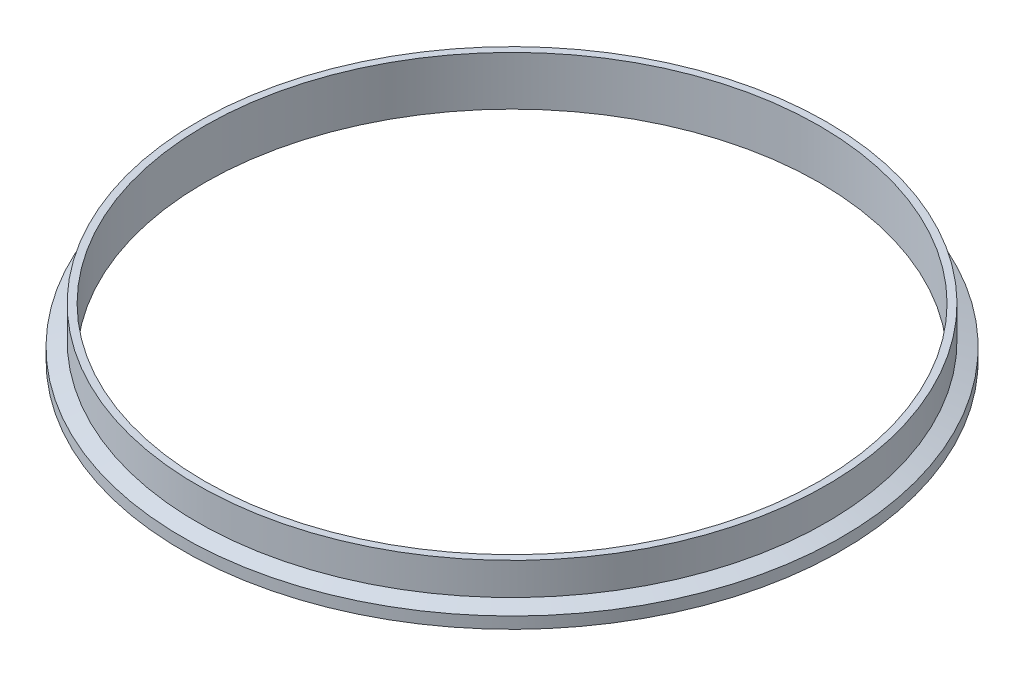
ISO-10303-21;
HEADER;
FILE_DESCRIPTION(('STEP AP214'),'2;1');
FILE_NAME('part.step','',(''),(''),'','','');
FILE_SCHEMA(('AUTOMOTIVE_DESIGN { 1 0 10303 214 1 1 1 1 }'));
ENDSEC;
DATA;
#1=APPLICATION_CONTEXT('core data for automotive mechanical design processes');
#2=APPLICATION_PROTOCOL_DEFINITION('international standard','automotive_design',2000,#1);
#3=PRODUCT_CONTEXT('',#1,'mechanical');
#4=PRODUCT('Part','Part','',(#3));
#5=PRODUCT_RELATED_PRODUCT_CATEGORY('part','',(#4));
#6=PRODUCT_DEFINITION_FORMATION('','',#4);
#7=PRODUCT_DEFINITION_CONTEXT('part definition',#1,'design');
#8=PRODUCT_DEFINITION('design','',#6,#7);
#9=PRODUCT_DEFINITION_SHAPE('','',#8);
#10=(LENGTH_UNIT() NAMED_UNIT(*) SI_UNIT(.MILLI.,.METRE.));
#11=(NAMED_UNIT(*) PLANE_ANGLE_UNIT() SI_UNIT($,.RADIAN.));
#12=(NAMED_UNIT(*) SI_UNIT($,.STERADIAN.) SOLID_ANGLE_UNIT());
#13=UNCERTAINTY_MEASURE_WITH_UNIT(LENGTH_MEASURE(1.E-05),#10,'distance_accuracy_value','');
#14=(GEOMETRIC_REPRESENTATION_CONTEXT(3) GLOBAL_UNCERTAINTY_ASSIGNED_CONTEXT((#13)) GLOBAL_UNIT_ASSIGNED_CONTEXT((#10,
#11,#12)) REPRESENTATION_CONTEXT('',''));
#15=CARTESIAN_POINT('',(0.,0.,0.));
#16=DIRECTION('',(0.,0.,1.));
#17=DIRECTION('',(1.,0.,0.));
#18=AXIS2_PLACEMENT_3D('',#15,#16,#17);
#19=CARTESIAN_POINT('',(0.,0.7874,0.));
#20=DIRECTION('',(0.,-1.,0.));
#21=DIRECTION('',(0.,0.,-1.));
#22=AXIS2_PLACEMENT_3D('',#19,#20,#21);
#23=TOROIDAL_SURFACE('',#22,156.199208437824,0.787400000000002);
#24=CARTESIAN_POINT('',(0.,0.,0.));
#25=DIRECTION('',(0.,-1.,0.));
#26=DIRECTION('',(0.,0.,-1.));
#27=AXIS2_PLACEMENT_3D('',#24,#25,#26);
#28=CIRCLE('',#27,156.199208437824);
#29=CARTESIAN_POINT('',(0.,0.,-156.199208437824));
#30=VERTEX_POINT('',#29);
#31=EDGE_CURVE('E67',#30,#30,#28,.T.);
#32=ORIENTED_EDGE('',*,*,#31,.T.);
#33=EDGE_LOOP('',(#32));
#34=FACE_BOUND('',#33,.T.);
#35=CARTESIAN_POINT('',(0.,0.474458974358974,0.));
#36=DIRECTION('',(0.,-1.,0.));
#37=DIRECTION('',(0.,0.,-1.));
#38=AXIS2_PLACEMENT_3D('',#35,#36,#37);
#39=CIRCLE('',#38,155.476666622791);
#40=CARTESIAN_POINT('',(0.,0.474458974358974,-155.476666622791));
#41=VERTEX_POINT('',#40);
#42=EDGE_CURVE('E10',#41,#41,#39,.T.);
#43=ORIENTED_EDGE('',*,*,#42,.F.);
#44=EDGE_LOOP('',(#43));
#45=FACE_BOUND('',#44,.T.);
#46=ADVANCED_FACE('F33',(#34,#45),#23,.T.);
#47=CARTESIAN_POINT('',(0.,0.,0.));
#48=DIRECTION('',(0.,-1.,0.));
#49=DIRECTION('',(0.,0.,-1.));
#50=AXIS2_PLACEMENT_3D('',#47,#48,#49);
#51=TOROIDAL_SURFACE('',#50,154.3812,1.1938);
#52=CARTESIAN_POINT('',(0.,0.474458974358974,0.));
#53=DIRECTION('',(0.,-1.,0.));
#54=DIRECTION('',(0.,0.,-1.));
#55=AXIS2_PLACEMENT_3D('',#52,#53,#54);
#56=CIRCLE('',#55,153.285733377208);
#57=CARTESIAN_POINT('',(0.,0.474458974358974,-153.285733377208));
#58=VERTEX_POINT('',#57);
#59=EDGE_CURVE('E39',#58,#58,#56,.T.);
#60=ORIENTED_EDGE('',*,*,#59,.F.);
#61=EDGE_LOOP('',(#60));
#62=FACE_BOUND('',#61,.T.);
#63=ORIENTED_EDGE('',*,*,#42,.T.);
#64=EDGE_LOOP('',(#63));
#65=FACE_BOUND('',#64,.T.);
#66=ADVANCED_FACE('F115',(#62,#65),#51,.F.);
#67=CARTESIAN_POINT('',(0.,0.7874,0.));
#68=DIRECTION('',(0.,-1.,0.));
#69=DIRECTION('',(0.,0.,-1.));
#70=AXIS2_PLACEMENT_3D('',#67,#68,#69);
#71=TOROIDAL_SURFACE('',#70,152.563191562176,0.787400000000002);
#72=ORIENTED_EDGE('',*,*,#59,.T.);
#73=EDGE_LOOP('',(#72));
#74=FACE_BOUND('',#73,.T.);
#75=CARTESIAN_POINT('',(0.,0.,0.));
#76=DIRECTION('',(0.,-1.,0.));
#77=DIRECTION('',(0.,0.,-1.));
#78=AXIS2_PLACEMENT_3D('',#75,#76,#77);
#79=CIRCLE('',#78,152.563191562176);
#80=CARTESIAN_POINT('',(0.,0.,-152.563191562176));
#81=VERTEX_POINT('',#80);
#82=EDGE_CURVE('E43',#81,#81,#79,.T.);
#83=ORIENTED_EDGE('',*,*,#82,.F.);
#84=EDGE_LOOP('',(#83));
#85=FACE_BOUND('',#84,.T.);
#86=ADVANCED_FACE('F111',(#74,#85),#71,.T.);
#87=CARTESIAN_POINT('',(0.,0.,0.));
#88=DIRECTION('',(0.,1.,0.));
#89=DIRECTION('',(0.,0.,1.));
#90=AXIS2_PLACEMENT_3D('',#87,#88,#89);
#91=PLANE('',#90);
#92=CARTESIAN_POINT('',(0.,0.,0.));
#93=DIRECTION('',(0.,-1.,0.));
#94=DIRECTION('',(0.,0.,-1.));
#95=AXIS2_PLACEMENT_3D('',#92,#93,#94);
#96=CIRCLE('',#95,148.9964);
#97=CARTESIAN_POINT('',(0.,0.,-148.9964));
#98=VERTEX_POINT('',#97);
#99=EDGE_CURVE('E47',#98,#98,#96,.T.);
#100=ORIENTED_EDGE('',*,*,#99,.F.);
#101=EDGE_LOOP('',(#100));
#102=FACE_BOUND('',#101,.T.);
#103=ORIENTED_EDGE('',*,*,#82,.T.);
#104=EDGE_LOOP('',(#103));
#105=FACE_BOUND('',#104,.T.);
#106=ADVANCED_FACE('F105',(#102,#105),#91,.F.);
#107=CARTESIAN_POINT('',(0.,0.,0.));
#108=DIRECTION('',(0.,-1.,0.));
#109=DIRECTION('',(0.,0.,-1.));
#110=AXIS2_PLACEMENT_3D('',#107,#108,#109);
#111=CYLINDRICAL_SURFACE('',#110,148.9964);
#112=ORIENTED_EDGE('',*,*,#99,.T.);
#113=EDGE_LOOP('',(#112));
#114=FACE_BOUND('',#113,.T.);
#115=CARTESIAN_POINT('',(0.,23.8125,0.));
#116=DIRECTION('',(0.,-1.,0.));
#117=DIRECTION('',(0.,0.,-1.));
#118=AXIS2_PLACEMENT_3D('',#115,#116,#117);
#119=CIRCLE('',#118,148.9964);
#120=CARTESIAN_POINT('',(0.,23.8125,-148.9964));
#121=VERTEX_POINT('',#120);
#122=EDGE_CURVE('E52',#121,#121,#119,.T.);
#123=ORIENTED_EDGE('',*,*,#122,.F.);
#124=EDGE_LOOP('',(#123));
#125=FACE_BOUND('',#124,.T.);
#126=ADVANCED_FACE('F100',(#114,#125),#111,.F.);
#127=CARTESIAN_POINT('',(0.,23.8125,0.));
#128=DIRECTION('',(0.,-1.,0.));
#129=DIRECTION('',(0.,0.,-1.));
#130=AXIS2_PLACEMENT_3D('',#127,#128,#129);
#131=PLANE('',#130);
#132=CARTESIAN_POINT('',(0.,23.8125,0.));
#133=DIRECTION('',(0.,-1.,0.));
#134=DIRECTION('',(0.,0.,-1.));
#135=AXIS2_PLACEMENT_3D('',#132,#133,#134);
#136=CIRCLE('',#135,152.4);
#137=CARTESIAN_POINT('',(0.,23.8125,-152.4));
#138=VERTEX_POINT('',#137);
#139=EDGE_CURVE('E55',#138,#138,#136,.T.);
#140=ORIENTED_EDGE('',*,*,#139,.F.);
#141=EDGE_LOOP('',(#140));
#142=FACE_BOUND('',#141,.T.);
#143=ORIENTED_EDGE('',*,*,#122,.T.);
#144=EDGE_LOOP('',(#143));
#145=FACE_BOUND('',#144,.T.);
#146=ADVANCED_FACE('F94',(#142,#145),#131,.F.);
#147=CARTESIAN_POINT('',(0.,0.,0.));
#148=DIRECTION('',(0.,-1.,0.));
#149=DIRECTION('',(0.,0.,-1.));
#150=AXIS2_PLACEMENT_3D('',#147,#148,#149);
#151=CYLINDRICAL_SURFACE('',#150,152.4);
#152=CARTESIAN_POINT('',(0.,8.22278052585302,0.));
#153=DIRECTION('',(0.,-1.,0.));
#154=DIRECTION('',(0.,0.,-1.));
#155=AXIS2_PLACEMENT_3D('',#152,#153,#154);
#156=CIRCLE('',#155,152.4);
#157=CARTESIAN_POINT('',(0.,8.22278052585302,-152.4));
#158=VERTEX_POINT('',#157);
#159=EDGE_CURVE('E58',#158,#158,#156,.T.);
#160=ORIENTED_EDGE('',*,*,#159,.F.);
#161=EDGE_LOOP('',(#160));
#162=FACE_BOUND('',#161,.T.);
#163=ORIENTED_EDGE('',*,*,#139,.T.);
#164=EDGE_LOOP('',(#163));
#165=FACE_BOUND('',#164,.T.);
#166=ADVANCED_FACE('F88',(#162,#165),#151,.T.);
#167=CARTESIAN_POINT('',(0.,8.22278052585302,0.));
#168=DIRECTION('',(0.,-1.,0.));
#169=DIRECTION('',(0.,0.,-1.));
#170=AXIS2_PLACEMENT_3D('',#167,#168,#169);
#171=CONICAL_SURFACE('',#170,152.4,1.22173047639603);
#172=CARTESIAN_POINT('',(0.,5.58799999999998,0.));
#173=DIRECTION('',(0.,-1.,0.));
#174=DIRECTION('',(0.,0.,-1.));
#175=AXIS2_PLACEMENT_3D('',#172,#173,#174);
#176=CIRCLE('',#175,159.639);
#177=CARTESIAN_POINT('',(0.,5.58799999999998,-159.639));
#178=VERTEX_POINT('',#177);
#179=EDGE_CURVE('E61',#178,#178,#176,.T.);
#180=ORIENTED_EDGE('',*,*,#179,.F.);
#181=EDGE_LOOP('',(#180));
#182=FACE_BOUND('',#181,.T.);
#183=ORIENTED_EDGE('',*,*,#159,.T.);
#184=EDGE_LOOP('',(#183));
#185=FACE_BOUND('',#184,.T.);
#186=ADVANCED_FACE('F82',(#182,#185),#171,.T.);
#187=CARTESIAN_POINT('',(0.,0.,0.));
#188=DIRECTION('',(0.,-1.,0.));
#189=DIRECTION('',(0.,0.,-1.));
#190=AXIS2_PLACEMENT_3D('',#187,#188,#189);
#191=CYLINDRICAL_SURFACE('',#190,159.639);
#192=CARTESIAN_POINT('',(0.,0.,0.));
#193=DIRECTION('',(0.,-1.,0.));
#194=DIRECTION('',(0.,0.,-1.));
#195=AXIS2_PLACEMENT_3D('',#192,#193,#194);
#196=CIRCLE('',#195,159.639);
#197=CARTESIAN_POINT('',(0.,0.,-159.639));
#198=VERTEX_POINT('',#197);
#199=EDGE_CURVE('E64',#198,#198,#196,.T.);
#200=ORIENTED_EDGE('',*,*,#199,.F.);
#201=EDGE_LOOP('',(#200));
#202=FACE_BOUND('',#201,.T.);
#203=ORIENTED_EDGE('',*,*,#179,.T.);
#204=EDGE_LOOP('',(#203));
#205=FACE_BOUND('',#204,.T.);
#206=ADVANCED_FACE('F76',(#202,#205),#191,.T.);
#207=CARTESIAN_POINT('',(0.,0.,0.));
#208=DIRECTION('',(0.,1.,0.));
#209=DIRECTION('',(0.,0.,1.));
#210=AXIS2_PLACEMENT_3D('',#207,#208,#209);
#211=PLANE('',#210);
#212=ORIENTED_EDGE('',*,*,#31,.F.);
#213=EDGE_LOOP('',(#212));
#214=FACE_BOUND('',#213,.T.);
#215=ORIENTED_EDGE('',*,*,#199,.T.);
#216=EDGE_LOOP('',(#215));
#217=FACE_BOUND('',#216,.T.);
#218=ADVANCED_FACE('F73',(#214,#217),#211,.F.);
#219=CLOSED_SHELL('',(#46,#66,#86,#106,#126,#146,#166,#186,#206,#218));
#220=MANIFOLD_SOLID_BREP('B2',#219);
#221=ADVANCED_BREP_SHAPE_REPRESENTATION('',(#18,#220),#14);
#222=SHAPE_DEFINITION_REPRESENTATION(#9,#221);
ENDSEC;
END-ISO-10303-21;
